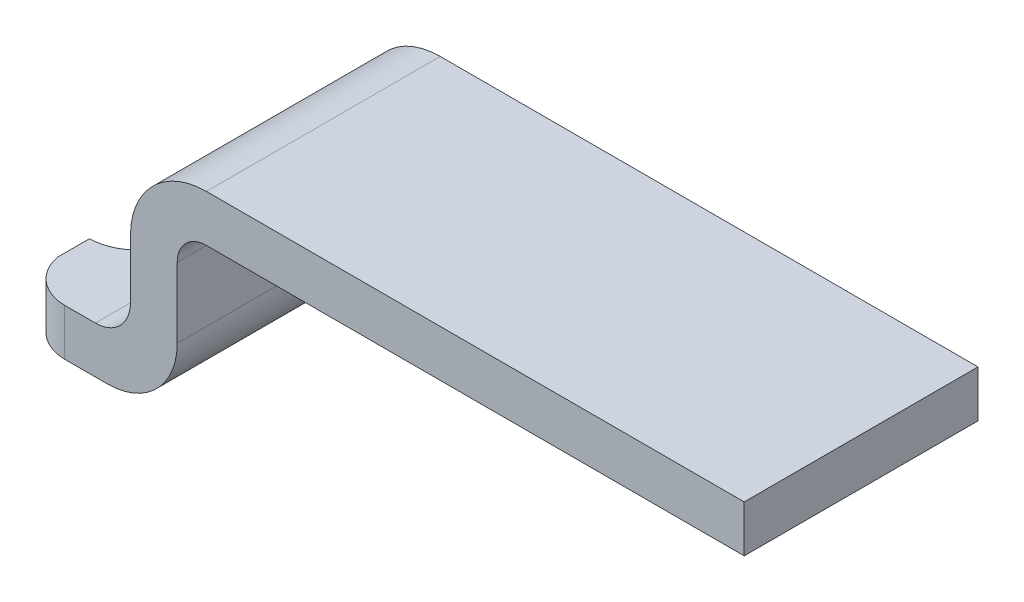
ISO-10303-21;
HEADER;
FILE_DESCRIPTION(('STEP AP214'),'2;1');
FILE_NAME('part.step','',(''),(''),'','','');
FILE_SCHEMA(('AUTOMOTIVE_DESIGN { 1 0 10303 214 1 1 1 1 }'));
ENDSEC;
DATA;
#1=APPLICATION_CONTEXT('core data for automotive mechanical design processes');
#2=APPLICATION_PROTOCOL_DEFINITION('international standard','automotive_design',2000,#1);
#3=PRODUCT_CONTEXT('',#1,'mechanical');
#4=PRODUCT('Part','Part','',(#3));
#5=PRODUCT_RELATED_PRODUCT_CATEGORY('part','',(#4));
#6=PRODUCT_DEFINITION_FORMATION('','',#4);
#7=PRODUCT_DEFINITION_CONTEXT('part definition',#1,'design');
#8=PRODUCT_DEFINITION('design','',#6,#7);
#9=PRODUCT_DEFINITION_SHAPE('','',#8);
#10=(LENGTH_UNIT() NAMED_UNIT(*) SI_UNIT(.MILLI.,.METRE.));
#11=(NAMED_UNIT(*) PLANE_ANGLE_UNIT() SI_UNIT($,.RADIAN.));
#12=(NAMED_UNIT(*) SI_UNIT($,.STERADIAN.) SOLID_ANGLE_UNIT());
#13=UNCERTAINTY_MEASURE_WITH_UNIT(LENGTH_MEASURE(1.E-05),#10,'distance_accuracy_value','');
#14=(GEOMETRIC_REPRESENTATION_CONTEXT(3) GLOBAL_UNCERTAINTY_ASSIGNED_CONTEXT((#13)) GLOBAL_UNIT_ASSIGNED_CONTEXT((#10,
#11,#12)) REPRESENTATION_CONTEXT('',''));
#15=CARTESIAN_POINT('',(0.,0.,0.));
#16=DIRECTION('',(0.,0.,1.));
#17=DIRECTION('',(1.,0.,0.));
#18=AXIS2_PLACEMENT_3D('',#15,#16,#17);
#19=CARTESIAN_POINT('',(-3.45,0.3,-9.));
#20=DIRECTION('',(0.,1.,0.));
#21=DIRECTION('',(1.,0.,0.));
#22=AXIS2_PLACEMENT_3D('',#19,#20,#21);
#23=PLANE('',#22);
#24=DIRECTION('',(0.,0.,-1.));
#25=VECTOR('',#24,1.);
#26=CARTESIAN_POINT('',(-4.1,0.3,-9.));
#27=LINE('',#26,#25);
#28=CARTESIAN_POINT('',(-4.1,0.3,-9.32633336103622));
#29=VERTEX_POINT('',#28);
#30=CARTESIAN_POINT('',(-4.1,0.3,-9.6));
#31=VERTEX_POINT('',#30);
#32=EDGE_CURVE('E41',#29,#31,#27,.T.);
#33=ORIENTED_EDGE('',*,*,#32,.F.);
#34=CARTESIAN_POINT('',(-3.70683202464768,0.3,-9.39994683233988));
#35=DIRECTION('',(0.,1.,0.));
#36=DIRECTION('',(-1.,0.,0.));
#37=AXIS2_PLACEMENT_3D('',#34,#35,#36);
#38=CIRCLE('',#37,0.4);
#39=CARTESIAN_POINT('',(-3.71335362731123,0.3,-9.));
#40=VERTEX_POINT('',#39);
#41=EDGE_CURVE('E11',#29,#40,#38,.T.);
#42=ORIENTED_EDGE('',*,*,#41,.T.);
#43=DIRECTION('',(1.,0.,0.));
#44=VECTOR('',#43,1.);
#45=CARTESIAN_POINT('',(-3.45,0.3,-9.));
#46=LINE('',#45,#44);
#47=CARTESIAN_POINT('',(-3.45,0.3,-9.));
#48=VERTEX_POINT('',#47);
#49=EDGE_CURVE('E27',#40,#48,#46,.T.);
#50=ORIENTED_EDGE('',*,*,#49,.T.);
#51=DIRECTION('',(0.,0.,-1.));
#52=VECTOR('',#51,1.);
#53=CARTESIAN_POINT('',(-3.45,0.3,-9.));
#54=LINE('',#53,#52);
#55=CARTESIAN_POINT('',(-3.45,0.3,-11.));
#56=VERTEX_POINT('',#55);
#57=EDGE_CURVE('E147',#48,#56,#54,.T.);
#58=ORIENTED_EDGE('',*,*,#57,.T.);
#59=DIRECTION('',(1.,0.,0.));
#60=VECTOR('',#59,1.);
#61=CARTESIAN_POINT('',(-3.45,0.3,-11.));
#62=LINE('',#61,#60);
#63=CARTESIAN_POINT('',(-3.7280808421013,0.3,-11.));
#64=VERTEX_POINT('',#63);
#65=EDGE_CURVE('E200',#64,#56,#62,.T.);
#66=ORIENTED_EDGE('',*,*,#65,.F.);
#67=CARTESIAN_POINT('',(-3.70478861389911,0.3,-10.600678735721));
#68=DIRECTION('',(0.,1.,0.));
#69=DIRECTION('',(-1.,0.,0.));
#70=AXIS2_PLACEMENT_3D('',#67,#68,#69);
#71=CIRCLE('',#70,0.399999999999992);
#72=CARTESIAN_POINT('',(-4.1,0.3,-10.6623874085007));
#73=VERTEX_POINT('',#72);
#74=EDGE_CURVE('E267',#64,#73,#71,.T.);
#75=ORIENTED_EDGE('',*,*,#74,.T.);
#76=DIRECTION('',(0.,0.,-1.));
#77=VECTOR('',#76,1.);
#78=CARTESIAN_POINT('',(-4.1,0.3,-9.));
#79=LINE('',#78,#77);
#80=CARTESIAN_POINT('',(-4.1,0.3,-10.4));
#81=VERTEX_POINT('',#80);
#82=EDGE_CURVE('E280',#81,#73,#79,.T.);
#83=ORIENTED_EDGE('',*,*,#82,.F.);
#84=CARTESIAN_POINT('',(-4.1,0.3,-10.));
#85=DIRECTION('',(0.,1.,0.));
#86=DIRECTION('',(-1.,0.,0.));
#87=AXIS2_PLACEMENT_3D('',#84,#85,#86);
#88=CIRCLE('',#87,0.4);
#89=EDGE_CURVE('E211',#31,#81,#88,.T.);
#90=ORIENTED_EDGE('',*,*,#89,.F.);
#91=EDGE_LOOP('',(#33,#42,#50,#58,#66,#75,#83,#90));
#92=FACE_BOUND('',#91,.T.);
#93=ADVANCED_FACE('F16',(#92),#23,.T.);
#94=CARTESIAN_POINT('',(-4.1,0.3,-9.));
#95=DIRECTION('',(-1.,0.,0.));
#96=DIRECTION('',(0.,0.,1.));
#97=AXIS2_PLACEMENT_3D('',#94,#95,#96);
#98=PLANE('',#97);
#99=DIRECTION('',(0.,0.,-1.));
#100=VECTOR('',#99,1.);
#101=CARTESIAN_POINT('',(-4.1,-0.1,-9.));
#102=LINE('',#101,#100);
#103=CARTESIAN_POINT('',(-4.1,-0.1,-9.32633336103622));
#104=VERTEX_POINT('',#103);
#105=CARTESIAN_POINT('',(-4.1,-0.1,-9.6));
#106=VERTEX_POINT('',#105);
#107=EDGE_CURVE('E248',#104,#106,#102,.T.);
#108=ORIENTED_EDGE('',*,*,#107,.F.);
#109=DIRECTION('',(0.,1.,0.));
#110=VECTOR('',#109,1.);
#111=CARTESIAN_POINT('',(-4.1,-0.8,-9.32633336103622));
#112=LINE('',#111,#110);
#113=EDGE_CURVE('E271',#104,#29,#112,.T.);
#114=ORIENTED_EDGE('',*,*,#113,.T.);
#115=ORIENTED_EDGE('',*,*,#32,.T.);
#116=DIRECTION('',(0.,1.,0.));
#117=VECTOR('',#116,1.);
#118=CARTESIAN_POINT('',(-4.1,-0.8,-9.6));
#119=LINE('',#118,#117);
#120=EDGE_CURVE('E212',#106,#31,#119,.T.);
#121=ORIENTED_EDGE('',*,*,#120,.F.);
#122=EDGE_LOOP('',(#108,#114,#115,#121));
#123=FACE_BOUND('',#122,.T.);
#124=ADVANCED_FACE('F340',(#123),#98,.T.);
#125=CARTESIAN_POINT('',(-4.1,0.3,-9.));
#126=DIRECTION('',(-1.,0.,0.));
#127=DIRECTION('',(0.,0.,1.));
#128=AXIS2_PLACEMENT_3D('',#125,#126,#127);
#129=PLANE('',#128);
#130=ORIENTED_EDGE('',*,*,#82,.T.);
#131=DIRECTION('',(0.,1.,0.));
#132=VECTOR('',#131,1.);
#133=CARTESIAN_POINT('',(-4.1,-0.8,-10.6623874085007));
#134=LINE('',#133,#132);
#135=CARTESIAN_POINT('',(-4.1,-0.1,-10.6623874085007));
#136=VERTEX_POINT('',#135);
#137=EDGE_CURVE('E217',#136,#73,#134,.T.);
#138=ORIENTED_EDGE('',*,*,#137,.F.);
#139=DIRECTION('',(0.,0.,-1.));
#140=VECTOR('',#139,1.);
#141=CARTESIAN_POINT('',(-4.1,-0.1,-9.));
#142=LINE('',#141,#140);
#143=CARTESIAN_POINT('',(-4.1,-0.1,-10.4));
#144=VERTEX_POINT('',#143);
#145=EDGE_CURVE('E253',#144,#136,#142,.T.);
#146=ORIENTED_EDGE('',*,*,#145,.F.);
#147=DIRECTION('',(0.,1.,0.));
#148=VECTOR('',#147,1.);
#149=CARTESIAN_POINT('',(-4.1,-0.8,-10.4));
#150=LINE('',#149,#148);
#151=EDGE_CURVE('E293',#144,#81,#150,.T.);
#152=ORIENTED_EDGE('',*,*,#151,.T.);
#153=EDGE_LOOP('',(#130,#138,#146,#152));
#154=FACE_BOUND('',#153,.T.);
#155=ADVANCED_FACE('F327',(#154),#129,.T.);
#156=CARTESIAN_POINT('',(-4.1,-0.1,-9.));
#157=DIRECTION('',(0.,-1.,0.));
#158=DIRECTION('',(-1.,0.,0.));
#159=AXIS2_PLACEMENT_3D('',#156,#157,#158);
#160=PLANE('',#159);
#161=DIRECTION('',(-1.,0.,0.));
#162=VECTOR('',#161,1.);
#163=CARTESIAN_POINT('',(-4.1,-0.1,-9.));
#164=LINE('',#163,#162);
#165=CARTESIAN_POINT('',(-3.35,-0.1,-9.));
#166=VERTEX_POINT('',#165);
#167=CARTESIAN_POINT('',(-3.71335362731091,-0.1,-9.));
#168=VERTEX_POINT('',#167);
#169=EDGE_CURVE('E287',#166,#168,#164,.T.);
#170=ORIENTED_EDGE('',*,*,#169,.T.);
#171=CARTESIAN_POINT('',(-3.70683202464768,-0.1,-9.39994683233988));
#172=DIRECTION('',(0.,-1.,0.));
#173=DIRECTION('',(1.,0.,0.));
#174=AXIS2_PLACEMENT_3D('',#171,#172,#173);
#175=CIRCLE('',#174,0.4);
#176=EDGE_CURVE('E252',#168,#104,#175,.T.);
#177=ORIENTED_EDGE('',*,*,#176,.T.);
#178=ORIENTED_EDGE('',*,*,#107,.T.);
#179=CARTESIAN_POINT('',(-4.1,-0.1,-10.));
#180=DIRECTION('',(0.,-1.,0.));
#181=DIRECTION('',(1.,0.,0.));
#182=AXIS2_PLACEMENT_3D('',#179,#180,#181);
#183=CIRCLE('',#182,0.4);
#184=EDGE_CURVE('E207',#144,#106,#183,.T.);
#185=ORIENTED_EDGE('',*,*,#184,.F.);
#186=ORIENTED_EDGE('',*,*,#145,.T.);
#187=CARTESIAN_POINT('',(-3.70478861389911,-0.1,-10.600678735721));
#188=DIRECTION('',(0.,-1.,0.));
#189=DIRECTION('',(1.,0.,0.));
#190=AXIS2_PLACEMENT_3D('',#187,#188,#189);
#191=CIRCLE('',#190,0.399999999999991);
#192=CARTESIAN_POINT('',(-3.72808084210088,-0.1,-11.));
#193=VERTEX_POINT('',#192);
#194=EDGE_CURVE('E303',#136,#193,#191,.T.);
#195=ORIENTED_EDGE('',*,*,#194,.T.);
#196=DIRECTION('',(-1.,0.,0.));
#197=VECTOR('',#196,1.);
#198=CARTESIAN_POINT('',(-4.1,-0.1,-11.));
#199=LINE('',#198,#197);
#200=CARTESIAN_POINT('',(-3.35,-0.1,-11.));
#201=VERTEX_POINT('',#200);
#202=EDGE_CURVE('E307',#201,#193,#199,.T.);
#203=ORIENTED_EDGE('',*,*,#202,.F.);
#204=DIRECTION('',(0.,0.,-1.));
#205=VECTOR('',#204,1.);
#206=CARTESIAN_POINT('',(-3.35,-0.1,-9.));
#207=LINE('',#206,#205);
#208=EDGE_CURVE('E176',#166,#201,#207,.T.);
#209=ORIENTED_EDGE('',*,*,#208,.F.);
#210=EDGE_LOOP('',(#170,#177,#178,#185,#186,#195,#203,#209));
#211=FACE_BOUND('',#210,.T.);
#212=ADVANCED_FACE('F335',(#211),#160,.T.);
#213=CARTESIAN_POINT('',(-2.5,1.1,-9.));
#214=DIRECTION('',(0.,0.,-1.));
#215=DIRECTION('',(0.,-1.,0.));
#216=AXIS2_PLACEMENT_3D('',#213,#214,#215);
#217=PLANE('',#216);
#218=DIRECTION('',(0.,1.,0.));
#219=VECTOR('',#218,1.);
#220=CARTESIAN_POINT('',(-3.71335362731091,-0.8,-9.));
#221=LINE('',#220,#219);
#222=EDGE_CURVE('E266',#168,#40,#221,.T.);
#223=ORIENTED_EDGE('',*,*,#222,.F.);
#224=ORIENTED_EDGE('',*,*,#169,.F.);
#225=CARTESIAN_POINT('',(-3.35,0.5,-9.));
#226=DIRECTION('',(0.,0.,-1.));
#227=DIRECTION('',(1.,0.,0.));
#228=AXIS2_PLACEMENT_3D('',#225,#226,#227);
#229=CIRCLE('',#228,0.6);
#230=CARTESIAN_POINT('',(-2.75,0.5,-9.));
#231=VERTEX_POINT('',#230);
#232=EDGE_CURVE('E169',#231,#166,#229,.T.);
#233=ORIENTED_EDGE('',*,*,#232,.F.);
#234=DIRECTION('',(0.,-1.,0.));
#235=VECTOR('',#234,1.);
#236=CARTESIAN_POINT('',(-2.75,0.5,-9.));
#237=LINE('',#236,#235);
#238=CARTESIAN_POINT('',(-2.75,1.1,-9.));
#239=VERTEX_POINT('',#238);
#240=EDGE_CURVE('E261',#239,#231,#237,.T.);
#241=ORIENTED_EDGE('',*,*,#240,.F.);
#242=CARTESIAN_POINT('',(-2.5,1.1,-9.));
#243=DIRECTION('',(0.,0.,1.));
#244=DIRECTION('',(-1.,0.,0.));
#245=AXIS2_PLACEMENT_3D('',#242,#243,#244);
#246=CIRCLE('',#245,0.25);
#247=CARTESIAN_POINT('',(-2.5,1.35,-9.));
#248=VERTEX_POINT('',#247);
#249=EDGE_CURVE('E262',#248,#239,#246,.T.);
#250=ORIENTED_EDGE('',*,*,#249,.F.);
#251=DIRECTION('',(-1.,0.,0.));
#252=VECTOR('',#251,1.);
#253=CARTESIAN_POINT('',(2.1,1.35,-9.));
#254=LINE('',#253,#252);
#255=CARTESIAN_POINT('',(2.1,1.35,-9.));
#256=VERTEX_POINT('',#255);
#257=EDGE_CURVE('E181',#256,#248,#254,.T.);
#258=ORIENTED_EDGE('',*,*,#257,.F.);
#259=DIRECTION('',(0.,-1.,0.));
#260=VECTOR('',#259,1.);
#261=CARTESIAN_POINT('',(2.1,1.75,-9.));
#262=LINE('',#261,#260);
#263=CARTESIAN_POINT('',(2.1,1.75,-9.));
#264=VERTEX_POINT('',#263);
#265=EDGE_CURVE('E218',#264,#256,#262,.T.);
#266=ORIENTED_EDGE('',*,*,#265,.F.);
#267=DIRECTION('',(1.,0.,0.));
#268=VECTOR('',#267,1.);
#269=CARTESIAN_POINT('',(2.1,1.75,-9.));
#270=LINE('',#269,#268);
#271=CARTESIAN_POINT('',(-2.5,1.75,-9.));
#272=VERTEX_POINT('',#271);
#273=EDGE_CURVE('E190',#272,#264,#270,.T.);
#274=ORIENTED_EDGE('',*,*,#273,.F.);
#275=CARTESIAN_POINT('',(-2.5,1.1,-9.));
#276=DIRECTION('',(0.,0.,-1.));
#277=DIRECTION('',(1.,0.,0.));
#278=AXIS2_PLACEMENT_3D('',#275,#276,#277);
#279=CIRCLE('',#278,0.65);
#280=CARTESIAN_POINT('',(-3.15,1.1,-9.));
#281=VERTEX_POINT('',#280);
#282=EDGE_CURVE('E158',#281,#272,#279,.T.);
#283=ORIENTED_EDGE('',*,*,#282,.F.);
#284=DIRECTION('',(0.,1.,0.));
#285=VECTOR('',#284,1.);
#286=CARTESIAN_POINT('',(-3.15,1.1,-9.));
#287=LINE('',#286,#285);
#288=CARTESIAN_POINT('',(-3.15,0.6,-9.));
#289=VERTEX_POINT('',#288);
#290=EDGE_CURVE('E154',#289,#281,#287,.T.);
#291=ORIENTED_EDGE('',*,*,#290,.F.);
#292=CARTESIAN_POINT('',(-3.45,0.6,-9.));
#293=DIRECTION('',(0.,0.,1.));
#294=DIRECTION('',(-1.,0.,0.));
#295=AXIS2_PLACEMENT_3D('',#292,#293,#294);
#296=CIRCLE('',#295,0.3);
#297=EDGE_CURVE('E140',#48,#289,#296,.T.);
#298=ORIENTED_EDGE('',*,*,#297,.F.);
#299=ORIENTED_EDGE('',*,*,#49,.F.);
#300=EDGE_LOOP('',(#223,#224,#233,#241,#250,#258,#266,#274,#283,#291,#298,#299));
#301=FACE_BOUND('',#300,.T.);
#302=ADVANCED_FACE('F156',(#301),#217,.F.);
#303=CARTESIAN_POINT('',(-2.5,1.1,-11.));
#304=DIRECTION('',(0.,0.,-1.));
#305=DIRECTION('',(0.,-1.,0.));
#306=AXIS2_PLACEMENT_3D('',#303,#304,#305);
#307=PLANE('',#306);
#308=ORIENTED_EDGE('',*,*,#202,.T.);
#309=DIRECTION('',(0.,1.,0.));
#310=VECTOR('',#309,1.);
#311=CARTESIAN_POINT('',(-3.7280808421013,-0.8,-11.));
#312=LINE('',#311,#310);
#313=EDGE_CURVE('E20',#193,#64,#312,.T.);
#314=ORIENTED_EDGE('',*,*,#313,.T.);
#315=ORIENTED_EDGE('',*,*,#65,.T.);
#316=CARTESIAN_POINT('',(-3.45,0.6,-11.));
#317=DIRECTION('',(0.,0.,1.));
#318=DIRECTION('',(-1.,0.,0.));
#319=AXIS2_PLACEMENT_3D('',#316,#317,#318);
#320=CIRCLE('',#319,0.3);
#321=CARTESIAN_POINT('',(-3.15,0.6,-11.));
#322=VERTEX_POINT('',#321);
#323=EDGE_CURVE('E197',#56,#322,#320,.T.);
#324=ORIENTED_EDGE('',*,*,#323,.T.);
#325=DIRECTION('',(0.,1.,0.));
#326=VECTOR('',#325,1.);
#327=CARTESIAN_POINT('',(-3.15,1.1,-11.));
#328=LINE('',#327,#326);
#329=CARTESIAN_POINT('',(-3.15,1.1,-11.));
#330=VERTEX_POINT('',#329);
#331=EDGE_CURVE('E166',#322,#330,#328,.T.);
#332=ORIENTED_EDGE('',*,*,#331,.T.);
#333=CARTESIAN_POINT('',(-2.5,1.1,-11.));
#334=DIRECTION('',(0.,0.,-1.));
#335=DIRECTION('',(1.,0.,0.));
#336=AXIS2_PLACEMENT_3D('',#333,#334,#335);
#337=CIRCLE('',#336,0.65);
#338=CARTESIAN_POINT('',(-2.5,1.75,-11.));
#339=VERTEX_POINT('',#338);
#340=EDGE_CURVE('E195',#330,#339,#337,.T.);
#341=ORIENTED_EDGE('',*,*,#340,.T.);
#342=DIRECTION('',(1.,0.,0.));
#343=VECTOR('',#342,1.);
#344=CARTESIAN_POINT('',(2.1,1.75,-11.));
#345=LINE('',#344,#343);
#346=CARTESIAN_POINT('',(2.1,1.75,-11.));
#347=VERTEX_POINT('',#346);
#348=EDGE_CURVE('E191',#339,#347,#345,.T.);
#349=ORIENTED_EDGE('',*,*,#348,.T.);
#350=DIRECTION('',(0.,-1.,0.));
#351=VECTOR('',#350,1.);
#352=CARTESIAN_POINT('',(2.1,1.75,-11.));
#353=LINE('',#352,#351);
#354=CARTESIAN_POINT('',(2.1,1.35,-11.));
#355=VERTEX_POINT('',#354);
#356=EDGE_CURVE('E196',#347,#355,#353,.T.);
#357=ORIENTED_EDGE('',*,*,#356,.T.);
#358=DIRECTION('',(-1.,0.,0.));
#359=VECTOR('',#358,1.);
#360=CARTESIAN_POINT('',(2.1,1.35,-11.));
#361=LINE('',#360,#359);
#362=CARTESIAN_POINT('',(-2.5,1.35,-11.));
#363=VERTEX_POINT('',#362);
#364=EDGE_CURVE('E276',#355,#363,#361,.T.);
#365=ORIENTED_EDGE('',*,*,#364,.T.);
#366=CARTESIAN_POINT('',(-2.5,1.1,-11.));
#367=DIRECTION('',(0.,0.,1.));
#368=DIRECTION('',(-1.,0.,0.));
#369=AXIS2_PLACEMENT_3D('',#366,#367,#368);
#370=CIRCLE('',#369,0.25);
#371=CARTESIAN_POINT('',(-2.75,1.1,-11.));
#372=VERTEX_POINT('',#371);
#373=EDGE_CURVE('E244',#363,#372,#370,.T.);
#374=ORIENTED_EDGE('',*,*,#373,.T.);
#375=DIRECTION('',(0.,-1.,0.));
#376=VECTOR('',#375,1.);
#377=CARTESIAN_POINT('',(-2.75,0.5,-11.));
#378=LINE('',#377,#376);
#379=CARTESIAN_POINT('',(-2.75,0.5,-11.));
#380=VERTEX_POINT('',#379);
#381=EDGE_CURVE('E232',#372,#380,#378,.T.);
#382=ORIENTED_EDGE('',*,*,#381,.T.);
#383=CARTESIAN_POINT('',(-3.35,0.5,-11.));
#384=DIRECTION('',(0.,0.,-1.));
#385=DIRECTION('',(1.,0.,0.));
#386=AXIS2_PLACEMENT_3D('',#383,#384,#385);
#387=CIRCLE('',#386,0.6);
#388=EDGE_CURVE('E221',#380,#201,#387,.T.);
#389=ORIENTED_EDGE('',*,*,#388,.T.);
#390=EDGE_LOOP('',(#308,#314,#315,#324,#332,#341,#349,#357,#365,#374,#382,#389));
#391=FACE_BOUND('',#390,.T.);
#392=ADVANCED_FACE('F371',(#391),#307,.T.);
#393=CARTESIAN_POINT('',(2.1,1.75,-9.));
#394=DIRECTION('',(1.,0.,0.));
#395=DIRECTION('',(0.,1.,0.));
#396=AXIS2_PLACEMENT_3D('',#393,#394,#395);
#397=PLANE('',#396);
#398=ORIENTED_EDGE('',*,*,#356,.F.);
#399=DIRECTION('',(0.,0.,-1.));
#400=VECTOR('',#399,1.);
#401=CARTESIAN_POINT('',(2.1,1.75,-9.));
#402=LINE('',#401,#400);
#403=EDGE_CURVE('E186',#264,#347,#402,.T.);
#404=ORIENTED_EDGE('',*,*,#403,.F.);
#405=ORIENTED_EDGE('',*,*,#265,.T.);
#406=DIRECTION('',(0.,0.,-1.));
#407=VECTOR('',#406,1.);
#408=CARTESIAN_POINT('',(2.1,1.35,-9.));
#409=LINE('',#408,#407);
#410=EDGE_CURVE('E203',#256,#355,#409,.T.);
#411=ORIENTED_EDGE('',*,*,#410,.T.);
#412=EDGE_LOOP('',(#398,#404,#405,#411));
#413=FACE_BOUND('',#412,.T.);
#414=ADVANCED_FACE('F716',(#413),#397,.T.);
#415=CARTESIAN_POINT('',(2.1,1.75,-9.));
#416=DIRECTION('',(0.,1.,0.));
#417=DIRECTION('',(1.,0.,0.));
#418=AXIS2_PLACEMENT_3D('',#415,#416,#417);
#419=PLANE('',#418);
#420=ORIENTED_EDGE('',*,*,#348,.F.);
#421=DIRECTION('',(0.,0.,-1.));
#422=VECTOR('',#421,1.);
#423=CARTESIAN_POINT('',(-2.5,1.75,-9.));
#424=LINE('',#423,#422);
#425=EDGE_CURVE('E163',#272,#339,#424,.T.);
#426=ORIENTED_EDGE('',*,*,#425,.F.);
#427=ORIENTED_EDGE('',*,*,#273,.T.);
#428=ORIENTED_EDGE('',*,*,#403,.T.);
#429=EDGE_LOOP('',(#420,#426,#427,#428));
#430=FACE_BOUND('',#429,.T.);
#431=ADVANCED_FACE('F685',(#430),#419,.T.);
#432=CARTESIAN_POINT('',(-2.5,1.1,-9.));
#433=DIRECTION('',(0.,0.,-1.));
#434=DIRECTION('',(-1.,0.,0.));
#435=AXIS2_PLACEMENT_3D('',#432,#433,#434);
#436=CYLINDRICAL_SURFACE('',#435,0.65);
#437=ORIENTED_EDGE('',*,*,#340,.F.);
#438=DIRECTION('',(0.,0.,-1.));
#439=VECTOR('',#438,1.);
#440=CARTESIAN_POINT('',(-3.15,1.1,-9.));
#441=LINE('',#440,#439);
#442=EDGE_CURVE('E151',#281,#330,#441,.T.);
#443=ORIENTED_EDGE('',*,*,#442,.F.);
#444=ORIENTED_EDGE('',*,*,#282,.T.);
#445=ORIENTED_EDGE('',*,*,#425,.T.);
#446=EDGE_LOOP('',(#437,#443,#444,#445));
#447=FACE_BOUND('',#446,.T.);
#448=ADVANCED_FACE('F368',(#447),#436,.T.);
#449=CARTESIAN_POINT('',(-3.15,1.1,-9.));
#450=DIRECTION('',(-1.,0.,0.));
#451=DIRECTION('',(0.,0.,1.));
#452=AXIS2_PLACEMENT_3D('',#449,#450,#451);
#453=PLANE('',#452);
#454=ORIENTED_EDGE('',*,*,#331,.F.);
#455=DIRECTION('',(0.,0.,-1.));
#456=VECTOR('',#455,1.);
#457=CARTESIAN_POINT('',(-3.15,0.6,-9.));
#458=LINE('',#457,#456);
#459=EDGE_CURVE('E145',#289,#322,#458,.T.);
#460=ORIENTED_EDGE('',*,*,#459,.F.);
#461=ORIENTED_EDGE('',*,*,#290,.T.);
#462=ORIENTED_EDGE('',*,*,#442,.T.);
#463=EDGE_LOOP('',(#454,#460,#461,#462));
#464=FACE_BOUND('',#463,.T.);
#465=ADVANCED_FACE('F18',(#464),#453,.T.);
#466=CARTESIAN_POINT('',(-3.45,0.6,-9.));
#467=DIRECTION('',(0.,0.,-1.));
#468=DIRECTION('',(-1.,0.,0.));
#469=AXIS2_PLACEMENT_3D('',#466,#467,#468);
#470=CYLINDRICAL_SURFACE('',#469,0.3);
#471=ORIENTED_EDGE('',*,*,#323,.F.);
#472=ORIENTED_EDGE('',*,*,#57,.F.);
#473=ORIENTED_EDGE('',*,*,#297,.T.);
#474=ORIENTED_EDGE('',*,*,#459,.T.);
#475=EDGE_LOOP('',(#471,#472,#473,#474));
#476=FACE_BOUND('',#475,.T.);
#477=ADVANCED_FACE('F143',(#476),#470,.F.);
#478=CARTESIAN_POINT('',(-3.35,0.5,-9.));
#479=DIRECTION('',(0.,0.,-1.));
#480=DIRECTION('',(-1.,0.,0.));
#481=AXIS2_PLACEMENT_3D('',#478,#479,#480);
#482=CYLINDRICAL_SURFACE('',#481,0.6);
#483=ORIENTED_EDGE('',*,*,#388,.F.);
#484=DIRECTION('',(0.,0.,-1.));
#485=VECTOR('',#484,1.);
#486=CARTESIAN_POINT('',(-2.75,0.5,-9.));
#487=LINE('',#486,#485);
#488=EDGE_CURVE('E257',#231,#380,#487,.T.);
#489=ORIENTED_EDGE('',*,*,#488,.F.);
#490=ORIENTED_EDGE('',*,*,#232,.T.);
#491=ORIENTED_EDGE('',*,*,#208,.T.);
#492=EDGE_LOOP('',(#483,#489,#490,#491));
#493=FACE_BOUND('',#492,.T.);
#494=ADVANCED_FACE('F641',(#493),#482,.T.);
#495=CARTESIAN_POINT('',(-2.75,0.5,-9.));
#496=DIRECTION('',(1.,0.,0.));
#497=DIRECTION('',(0.,1.,0.));
#498=AXIS2_PLACEMENT_3D('',#495,#496,#497);
#499=PLANE('',#498);
#500=ORIENTED_EDGE('',*,*,#381,.F.);
#501=DIRECTION('',(0.,0.,-1.));
#502=VECTOR('',#501,1.);
#503=CARTESIAN_POINT('',(-2.75,1.1,-9.));
#504=LINE('',#503,#502);
#505=EDGE_CURVE('E184',#239,#372,#504,.T.);
#506=ORIENTED_EDGE('',*,*,#505,.F.);
#507=ORIENTED_EDGE('',*,*,#240,.T.);
#508=ORIENTED_EDGE('',*,*,#488,.T.);
#509=EDGE_LOOP('',(#500,#506,#507,#508));
#510=FACE_BOUND('',#509,.T.);
#511=ADVANCED_FACE('F618',(#510),#499,.T.);
#512=CARTESIAN_POINT('',(-2.5,1.1,-9.));
#513=DIRECTION('',(0.,0.,-1.));
#514=DIRECTION('',(-1.,0.,0.));
#515=AXIS2_PLACEMENT_3D('',#512,#513,#514);
#516=CYLINDRICAL_SURFACE('',#515,0.25);
#517=ORIENTED_EDGE('',*,*,#373,.F.);
#518=DIRECTION('',(0.,0.,-1.));
#519=VECTOR('',#518,1.);
#520=CARTESIAN_POINT('',(-2.5,1.35,-9.));
#521=LINE('',#520,#519);
#522=EDGE_CURVE('E185',#248,#363,#521,.T.);
#523=ORIENTED_EDGE('',*,*,#522,.F.);
#524=ORIENTED_EDGE('',*,*,#249,.T.);
#525=ORIENTED_EDGE('',*,*,#505,.T.);
#526=EDGE_LOOP('',(#517,#523,#524,#525));
#527=FACE_BOUND('',#526,.T.);
#528=ADVANCED_FACE('F612',(#527),#516,.F.);
#529=CARTESIAN_POINT('',(2.1,1.35,-9.));
#530=DIRECTION('',(0.,-1.,0.));
#531=DIRECTION('',(0.,0.,-1.));
#532=AXIS2_PLACEMENT_3D('',#529,#530,#531);
#533=PLANE('',#532);
#534=ORIENTED_EDGE('',*,*,#364,.F.);
#535=ORIENTED_EDGE('',*,*,#410,.F.);
#536=ORIENTED_EDGE('',*,*,#257,.T.);
#537=ORIENTED_EDGE('',*,*,#522,.T.);
#538=EDGE_LOOP('',(#534,#535,#536,#537));
#539=FACE_BOUND('',#538,.T.);
#540=ADVANCED_FACE('F617',(#539),#533,.T.);
#541=CARTESIAN_POINT('',(-3.70478861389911,-0.8,-10.600678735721));
#542=DIRECTION('',(0.,1.,0.));
#543=DIRECTION('',(0.,0.,1.));
#544=AXIS2_PLACEMENT_3D('',#541,#542,#543);
#545=CYLINDRICAL_SURFACE('',#544,0.399999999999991);
#546=ORIENTED_EDGE('',*,*,#313,.F.);
#547=ORIENTED_EDGE('',*,*,#194,.F.);
#548=ORIENTED_EDGE('',*,*,#137,.T.);
#549=ORIENTED_EDGE('',*,*,#74,.F.);
#550=EDGE_LOOP('',(#546,#547,#548,#549));
#551=FACE_BOUND('',#550,.T.);
#552=ADVANCED_FACE('F653',(#551),#545,.T.);
#553=CARTESIAN_POINT('',(-3.70683202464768,-0.8,-9.39994683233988));
#554=DIRECTION('',(0.,1.,0.));
#555=DIRECTION('',(0.,0.,1.));
#556=AXIS2_PLACEMENT_3D('',#553,#554,#555);
#557=CYLINDRICAL_SURFACE('',#556,0.4);
#558=ORIENTED_EDGE('',*,*,#113,.F.);
#559=ORIENTED_EDGE('',*,*,#176,.F.);
#560=ORIENTED_EDGE('',*,*,#222,.T.);
#561=ORIENTED_EDGE('',*,*,#41,.F.);
#562=EDGE_LOOP('',(#558,#559,#560,#561));
#563=FACE_BOUND('',#562,.T.);
#564=ADVANCED_FACE('F342',(#563),#557,.T.);
#565=CARTESIAN_POINT('',(-4.1,-0.8,-10.));
#566=DIRECTION('',(0.,1.,0.));
#567=DIRECTION('',(0.,0.,1.));
#568=AXIS2_PLACEMENT_3D('',#565,#566,#567);
#569=CYLINDRICAL_SURFACE('',#568,0.4);
#570=ORIENTED_EDGE('',*,*,#89,.T.);
#571=ORIENTED_EDGE('',*,*,#151,.F.);
#572=ORIENTED_EDGE('',*,*,#184,.T.);
#573=ORIENTED_EDGE('',*,*,#120,.T.);
#574=EDGE_LOOP('',(#570,#571,#572,#573));
#575=FACE_BOUND('',#574,.T.);
#576=ADVANCED_FACE('F332',(#575),#569,.F.);
#577=CLOSED_SHELL('',(#93,#124,#155,#212,#302,#392,#414,#431,#448,#465,#477,#494,#511,#528,#540,
#552,#564,#576));
#578=MANIFOLD_SOLID_BREP('B1',#577);
#579=ADVANCED_BREP_SHAPE_REPRESENTATION('',(#18,#578),#14);
#580=SHAPE_DEFINITION_REPRESENTATION(#9,#579);
ENDSEC;
END-ISO-10303-21;
